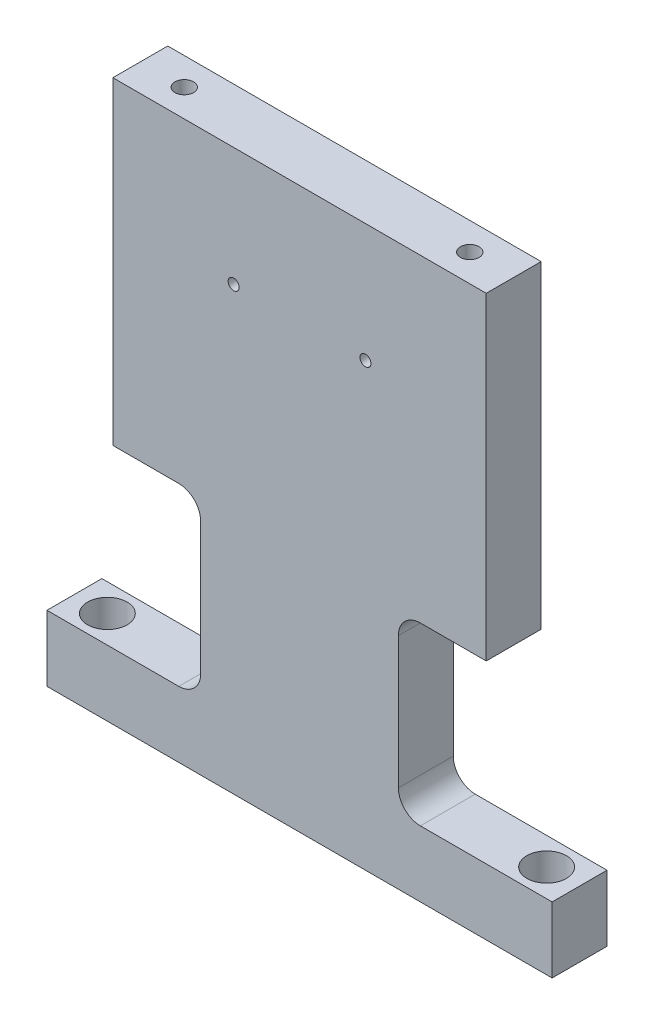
ISO-10303-21;
HEADER;
FILE_DESCRIPTION(('STEP AP214'),'2;1');
FILE_NAME('part.step','',(''),(''),'','','');
FILE_SCHEMA(('AUTOMOTIVE_DESIGN { 1 0 10303 214 1 1 1 1 }'));
ENDSEC;
DATA;
#1=APPLICATION_CONTEXT('core data for automotive mechanical design processes');
#2=APPLICATION_PROTOCOL_DEFINITION('international standard','automotive_design',2000,#1);
#3=PRODUCT_CONTEXT('',#1,'mechanical');
#4=PRODUCT('Part','Part','',(#3));
#5=PRODUCT_RELATED_PRODUCT_CATEGORY('part','',(#4));
#6=PRODUCT_DEFINITION_FORMATION('','',#4);
#7=PRODUCT_DEFINITION_CONTEXT('part definition',#1,'design');
#8=PRODUCT_DEFINITION('design','',#6,#7);
#9=PRODUCT_DEFINITION_SHAPE('','',#8);
#10=(LENGTH_UNIT() NAMED_UNIT(*) SI_UNIT(.MILLI.,.METRE.));
#11=(NAMED_UNIT(*) PLANE_ANGLE_UNIT() SI_UNIT($,.RADIAN.));
#12=(NAMED_UNIT(*) SI_UNIT($,.STERADIAN.) SOLID_ANGLE_UNIT());
#13=UNCERTAINTY_MEASURE_WITH_UNIT(LENGTH_MEASURE(1.E-05),#10,'distance_accuracy_value','');
#14=(GEOMETRIC_REPRESENTATION_CONTEXT(3) GLOBAL_UNCERTAINTY_ASSIGNED_CONTEXT((#13)) GLOBAL_UNIT_ASSIGNED_CONTEXT((#10,
#11,#12)) REPRESENTATION_CONTEXT('',''));
#15=CARTESIAN_POINT('',(0.,0.,0.));
#16=DIRECTION('',(0.,0.,1.));
#17=DIRECTION('',(1.,0.,0.));
#18=AXIS2_PLACEMENT_3D('',#15,#16,#17);
#19=CARTESIAN_POINT('',(0.,0.,25.));
#20=DIRECTION('',(0.,1.,0.));
#21=DIRECTION('',(0.,0.,1.));
#22=AXIS2_PLACEMENT_3D('',#19,#20,#21);
#23=PLANE('',#22);
#24=CARTESIAN_POINT('',(-15.,0.,12.5));
#25=DIRECTION('',(0.,1.,0.));
#26=DIRECTION('',(0.,0.,1.));
#27=AXIS2_PLACEMENT_3D('',#24,#25,#26);
#28=CIRCLE('',#27,5.24999999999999);
#29=CARTESIAN_POINT('',(-15.,0.,17.75));
#30=VERTEX_POINT('',#29);
#31=EDGE_CURVE('E228',#30,#30,#28,.T.);
#32=ORIENTED_EDGE('',*,*,#31,.T.);
#33=EDGE_LOOP('',(#32));
#34=FACE_BOUND('',#33,.T.);
#35=CARTESIAN_POINT('',(185.,0.,12.5));
#36=DIRECTION('',(0.,1.,0.));
#37=DIRECTION('',(0.,0.,1.));
#38=AXIS2_PLACEMENT_3D('',#35,#36,#37);
#39=CIRCLE('',#38,5.25);
#40=CARTESIAN_POINT('',(185.,0.,17.75));
#41=VERTEX_POINT('',#40);
#42=EDGE_CURVE('E240',#41,#41,#39,.T.);
#43=ORIENTED_EDGE('',*,*,#42,.T.);
#44=EDGE_LOOP('',(#43));
#45=FACE_BOUND('',#44,.T.);
#46=DIRECTION('',(1.,0.,0.));
#47=VECTOR('',#46,1.);
#48=CARTESIAN_POINT('',(0.,0.,0.));
#49=LINE('',#48,#47);
#50=CARTESIAN_POINT('',(-30.,0.,0.));
#51=VERTEX_POINT('',#50);
#52=CARTESIAN_POINT('',(200.,0.,0.));
#53=VERTEX_POINT('',#52);
#54=EDGE_CURVE('E96',#51,#53,#49,.T.);
#55=ORIENTED_EDGE('',*,*,#54,.T.);
#56=DIRECTION('',(0.,0.,1.));
#57=VECTOR('',#56,1.);
#58=CARTESIAN_POINT('',(200.,0.,0.));
#59=LINE('',#58,#57);
#60=CARTESIAN_POINT('',(200.,0.,25.));
#61=VERTEX_POINT('',#60);
#62=EDGE_CURVE('E256',#53,#61,#59,.T.);
#63=ORIENTED_EDGE('',*,*,#62,.T.);
#64=DIRECTION('',(1.,0.,0.));
#65=VECTOR('',#64,1.);
#66=CARTESIAN_POINT('',(0.,0.,25.));
#67=LINE('',#66,#65);
#68=CARTESIAN_POINT('',(-30.,0.,25.));
#69=VERTEX_POINT('',#68);
#70=EDGE_CURVE('E350',#69,#61,#67,.T.);
#71=ORIENTED_EDGE('',*,*,#70,.F.);
#72=DIRECTION('',(0.,0.,1.));
#73=VECTOR('',#72,1.);
#74=CARTESIAN_POINT('',(-30.,0.,0.));
#75=LINE('',#74,#73);
#76=EDGE_CURVE('E260',#51,#69,#75,.T.);
#77=ORIENTED_EDGE('',*,*,#76,.F.);
#78=EDGE_LOOP('',(#55,#63,#71,#77));
#79=FACE_BOUND('',#78,.T.);
#80=ADVANCED_FACE('F41',(#34,#45,#79),#23,.F.);
#81=CARTESIAN_POINT('',(170.,0.,25.));
#82=DIRECTION('',(-1.,0.,0.));
#83=DIRECTION('',(0.,0.,1.));
#84=AXIS2_PLACEMENT_3D('',#81,#82,#83);
#85=PLANE('',#84);
#86=DIRECTION('',(0.,1.,0.));
#87=VECTOR('',#86,1.);
#88=CARTESIAN_POINT('',(170.,0.,25.));
#89=LINE('',#88,#87);
#90=CARTESIAN_POINT('',(170.,110.,25.));
#91=VERTEX_POINT('',#90);
#92=CARTESIAN_POINT('',(170.,255.,25.));
#93=VERTEX_POINT('',#92);
#94=EDGE_CURVE('E351',#91,#93,#89,.T.);
#95=ORIENTED_EDGE('',*,*,#94,.F.);
#96=DIRECTION('',(0.,0.,-1.));
#97=VECTOR('',#96,1.);
#98=CARTESIAN_POINT('',(170.,110.,25.));
#99=LINE('',#98,#97);
#100=CARTESIAN_POINT('',(170.,110.,0.));
#101=VERTEX_POINT('',#100);
#102=EDGE_CURVE('E97',#91,#101,#99,.T.);
#103=ORIENTED_EDGE('',*,*,#102,.T.);
#104=DIRECTION('',(0.,1.,0.));
#105=VECTOR('',#104,1.);
#106=CARTESIAN_POINT('',(170.,0.,0.));
#107=LINE('',#106,#105);
#108=CARTESIAN_POINT('',(170.,255.,0.));
#109=VERTEX_POINT('',#108);
#110=EDGE_CURVE('E86',#101,#109,#107,.T.);
#111=ORIENTED_EDGE('',*,*,#110,.T.);
#112=DIRECTION('',(0.,0.,-1.));
#113=VECTOR('',#112,1.);
#114=CARTESIAN_POINT('',(170.,255.,25.));
#115=LINE('',#114,#113);
#116=EDGE_CURVE('E11',#93,#109,#115,.T.);
#117=ORIENTED_EDGE('',*,*,#116,.F.);
#118=EDGE_LOOP('',(#95,#103,#111,#117));
#119=FACE_BOUND('',#118,.T.);
#120=ADVANCED_FACE('F109',(#119),#85,.F.);
#121=CARTESIAN_POINT('',(0.,0.,25.));
#122=DIRECTION('',(1.,0.,0.));
#123=DIRECTION('',(0.,0.,-1.));
#124=AXIS2_PLACEMENT_3D('',#121,#122,#123);
#125=PLANE('',#124);
#126=DIRECTION('',(0.,-1.,0.));
#127=VECTOR('',#126,1.);
#128=CARTESIAN_POINT('',(0.,0.,0.));
#129=LINE('',#128,#127);
#130=CARTESIAN_POINT('',(0.,255.,0.));
#131=VERTEX_POINT('',#130);
#132=CARTESIAN_POINT('',(0.,110.,0.));
#133=VERTEX_POINT('',#132);
#134=EDGE_CURVE('E90',#131,#133,#129,.T.);
#135=ORIENTED_EDGE('',*,*,#134,.T.);
#136=DIRECTION('',(0.,0.,-1.));
#137=VECTOR('',#136,1.);
#138=CARTESIAN_POINT('',(0.,110.,25.));
#139=LINE('',#138,#137);
#140=CARTESIAN_POINT('',(0.,110.,25.));
#141=VERTEX_POINT('',#140);
#142=EDGE_CURVE('E56',#141,#133,#139,.T.);
#143=ORIENTED_EDGE('',*,*,#142,.F.);
#144=DIRECTION('',(0.,-1.,0.));
#145=VECTOR('',#144,1.);
#146=CARTESIAN_POINT('',(0.,0.,25.));
#147=LINE('',#146,#145);
#148=CARTESIAN_POINT('',(0.,255.,25.));
#149=VERTEX_POINT('',#148);
#150=EDGE_CURVE('E85',#149,#141,#147,.T.);
#151=ORIENTED_EDGE('',*,*,#150,.F.);
#152=DIRECTION('',(0.,0.,-1.));
#153=VECTOR('',#152,1.);
#154=CARTESIAN_POINT('',(0.,255.,25.));
#155=LINE('',#154,#153);
#156=EDGE_CURVE('E49',#149,#131,#155,.T.);
#157=ORIENTED_EDGE('',*,*,#156,.T.);
#158=EDGE_LOOP('',(#135,#143,#151,#157));
#159=FACE_BOUND('',#158,.T.);
#160=ADVANCED_FACE('F43',(#159),#125,.F.);
#161=CARTESIAN_POINT('',(0.,255.,25.));
#162=DIRECTION('',(0.,-1.,0.));
#163=DIRECTION('',(0.,0.,-1.));
#164=AXIS2_PLACEMENT_3D('',#161,#162,#163);
#165=PLANE('',#164);
#166=CARTESIAN_POINT('',(20.,255.,12.5));
#167=DIRECTION('',(0.,1.,0.));
#168=DIRECTION('',(0.,0.,1.));
#169=AXIS2_PLACEMENT_3D('',#166,#167,#168);
#170=CIRCLE('',#169,4.24999999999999);
#171=CARTESIAN_POINT('',(20.,255.,16.75));
#172=VERTEX_POINT('',#171);
#173=EDGE_CURVE('E209',#172,#172,#170,.T.);
#174=ORIENTED_EDGE('',*,*,#173,.F.);
#175=EDGE_LOOP('',(#174));
#176=FACE_BOUND('',#175,.T.);
#177=CARTESIAN_POINT('',(150.,255.,12.5));
#178=DIRECTION('',(0.,1.,0.));
#179=DIRECTION('',(0.,0.,1.));
#180=AXIS2_PLACEMENT_3D('',#177,#178,#179);
#181=CIRCLE('',#180,4.25);
#182=CARTESIAN_POINT('',(150.,255.,16.75));
#183=VERTEX_POINT('',#182);
#184=EDGE_CURVE('E208',#183,#183,#181,.T.);
#185=ORIENTED_EDGE('',*,*,#184,.F.);
#186=EDGE_LOOP('',(#185));
#187=FACE_BOUND('',#186,.T.);
#188=DIRECTION('',(-1.,0.,0.));
#189=VECTOR('',#188,1.);
#190=CARTESIAN_POINT('',(0.,255.,0.));
#191=LINE('',#190,#189);
#192=EDGE_CURVE('E77',#109,#131,#191,.T.);
#193=ORIENTED_EDGE('',*,*,#192,.T.);
#194=ORIENTED_EDGE('',*,*,#156,.F.);
#195=DIRECTION('',(-1.,0.,0.));
#196=VECTOR('',#195,1.);
#197=CARTESIAN_POINT('',(0.,255.,25.));
#198=LINE('',#197,#196);
#199=EDGE_CURVE('E65',#93,#149,#198,.T.);
#200=ORIENTED_EDGE('',*,*,#199,.F.);
#201=ORIENTED_EDGE('',*,*,#116,.T.);
#202=EDGE_LOOP('',(#193,#194,#200,#201));
#203=FACE_BOUND('',#202,.T.);
#204=ADVANCED_FACE('F79',(#176,#187,#203),#165,.F.);
#205=CARTESIAN_POINT('',(0.,255.,25.));
#206=DIRECTION('',(0.,0.,-1.));
#207=DIRECTION('',(-1.,0.,0.));
#208=AXIS2_PLACEMENT_3D('',#205,#206,#207);
#209=PLANE('',#208);
#210=CARTESIAN_POINT('',(55.,201.,25.));
#211=DIRECTION('',(0.,0.,-1.));
#212=DIRECTION('',(-1.,0.,0.));
#213=AXIS2_PLACEMENT_3D('',#210,#211,#212);
#214=CIRCLE('',#213,2.5);
#215=CARTESIAN_POINT('',(52.5,201.,25.));
#216=VERTEX_POINT('',#215);
#217=EDGE_CURVE('E259',#216,#216,#214,.T.);
#218=ORIENTED_EDGE('',*,*,#217,.T.);
#219=EDGE_LOOP('',(#218));
#220=FACE_BOUND('',#219,.T.);
#221=CARTESIAN_POINT('',(115.,201.,25.));
#222=DIRECTION('',(0.,0.,-1.));
#223=DIRECTION('',(-1.,0.,0.));
#224=AXIS2_PLACEMENT_3D('',#221,#222,#223);
#225=CIRCLE('',#224,2.5);
#226=CARTESIAN_POINT('',(112.5,201.,25.));
#227=VERTEX_POINT('',#226);
#228=EDGE_CURVE('E273',#227,#227,#225,.T.);
#229=ORIENTED_EDGE('',*,*,#228,.T.);
#230=EDGE_LOOP('',(#229));
#231=FACE_BOUND('',#230,.T.);
#232=CARTESIAN_POINT('',(30.,40.,25.));
#233=DIRECTION('',(0.,0.,-1.));
#234=DIRECTION('',(-1.,0.,0.));
#235=AXIS2_PLACEMENT_3D('',#232,#233,#234);
#236=CIRCLE('',#235,10.);
#237=CARTESIAN_POINT('',(40.,40.,25.));
#238=VERTEX_POINT('',#237);
#239=CARTESIAN_POINT('',(30.,30.,25.));
#240=VERTEX_POINT('',#239);
#241=EDGE_CURVE('E289',#238,#240,#236,.T.);
#242=ORIENTED_EDGE('',*,*,#241,.T.);
#243=DIRECTION('',(-1.,0.,0.));
#244=VECTOR('',#243,1.);
#245=CARTESIAN_POINT('',(30.,30.,25.));
#246=LINE('',#245,#244);
#247=CARTESIAN_POINT('',(-30.,30.,25.));
#248=VERTEX_POINT('',#247);
#249=EDGE_CURVE('E292',#240,#248,#246,.T.);
#250=ORIENTED_EDGE('',*,*,#249,.T.);
#251=DIRECTION('',(0.,-1.,0.));
#252=VECTOR('',#251,1.);
#253=CARTESIAN_POINT('',(-30.,30.,25.));
#254=LINE('',#253,#252);
#255=EDGE_CURVE('E248',#248,#69,#254,.T.);
#256=ORIENTED_EDGE('',*,*,#255,.T.);
#257=ORIENTED_EDGE('',*,*,#70,.T.);
#258=DIRECTION('',(0.,1.,0.));
#259=VECTOR('',#258,1.);
#260=CARTESIAN_POINT('',(200.,30.,25.));
#261=LINE('',#260,#259);
#262=CARTESIAN_POINT('',(200.,30.,25.));
#263=VERTEX_POINT('',#262);
#264=EDGE_CURVE('E243',#61,#263,#261,.T.);
#265=ORIENTED_EDGE('',*,*,#264,.T.);
#266=DIRECTION('',(-1.,0.,0.));
#267=VECTOR('',#266,1.);
#268=CARTESIAN_POINT('',(170.,30.,25.));
#269=LINE('',#268,#267);
#270=CARTESIAN_POINT('',(140.,30.,25.));
#271=VERTEX_POINT('',#270);
#272=EDGE_CURVE('E315',#263,#271,#269,.T.);
#273=ORIENTED_EDGE('',*,*,#272,.T.);
#274=CARTESIAN_POINT('',(140.,40.,25.));
#275=DIRECTION('',(0.,0.,-1.));
#276=DIRECTION('',(-1.,0.,0.));
#277=AXIS2_PLACEMENT_3D('',#274,#275,#276);
#278=CIRCLE('',#277,10.);
#279=CARTESIAN_POINT('',(130.,40.,25.));
#280=VERTEX_POINT('',#279);
#281=EDGE_CURVE('E318',#271,#280,#278,.T.);
#282=ORIENTED_EDGE('',*,*,#281,.T.);
#283=DIRECTION('',(0.,1.,0.));
#284=VECTOR('',#283,1.);
#285=CARTESIAN_POINT('',(130.,100.,25.));
#286=LINE('',#285,#284);
#287=CARTESIAN_POINT('',(130.,100.,25.));
#288=VERTEX_POINT('',#287);
#289=EDGE_CURVE('E321',#280,#288,#286,.T.);
#290=ORIENTED_EDGE('',*,*,#289,.T.);
#291=CARTESIAN_POINT('',(140.,100.,25.));
#292=DIRECTION('',(0.,0.,-1.));
#293=DIRECTION('',(1.,0.,0.));
#294=AXIS2_PLACEMENT_3D('',#291,#292,#293);
#295=CIRCLE('',#294,10.);
#296=CARTESIAN_POINT('',(140.,110.,25.));
#297=VERTEX_POINT('',#296);
#298=EDGE_CURVE('E324',#288,#297,#295,.T.);
#299=ORIENTED_EDGE('',*,*,#298,.T.);
#300=DIRECTION('',(1.,0.,0.));
#301=VECTOR('',#300,1.);
#302=CARTESIAN_POINT('',(170.,110.,25.));
#303=LINE('',#302,#301);
#304=EDGE_CURVE('E327',#297,#91,#303,.T.);
#305=ORIENTED_EDGE('',*,*,#304,.T.);
#306=ORIENTED_EDGE('',*,*,#94,.T.);
#307=ORIENTED_EDGE('',*,*,#199,.T.);
#308=ORIENTED_EDGE('',*,*,#150,.T.);
#309=DIRECTION('',(1.,0.,0.));
#310=VECTOR('',#309,1.);
#311=CARTESIAN_POINT('',(30.,110.,25.));
#312=LINE('',#311,#310);
#313=CARTESIAN_POINT('',(30.,110.,25.));
#314=VERTEX_POINT('',#313);
#315=EDGE_CURVE('E279',#141,#314,#312,.T.);
#316=ORIENTED_EDGE('',*,*,#315,.T.);
#317=CARTESIAN_POINT('',(30.,100.,25.));
#318=DIRECTION('',(0.,0.,-1.));
#319=DIRECTION('',(-1.,0.,0.));
#320=AXIS2_PLACEMENT_3D('',#317,#318,#319);
#321=CIRCLE('',#320,10.);
#322=CARTESIAN_POINT('',(40.,100.,25.));
#323=VERTEX_POINT('',#322);
#324=EDGE_CURVE('E282',#314,#323,#321,.T.);
#325=ORIENTED_EDGE('',*,*,#324,.T.);
#326=DIRECTION('',(0.,-1.,0.));
#327=VECTOR('',#326,1.);
#328=CARTESIAN_POINT('',(40.,100.,25.));
#329=LINE('',#328,#327);
#330=EDGE_CURVE('E286',#323,#238,#329,.T.);
#331=ORIENTED_EDGE('',*,*,#330,.T.);
#332=EDGE_LOOP('',(#242,#250,#256,#257,#265,#273,#282,#290,#299,#305,#306,#307,#308,#316,#325,#331));
#333=FACE_BOUND('',#332,.T.);
#334=ADVANCED_FACE('F352',(#220,#231,#333),#209,.F.);
#335=CARTESIAN_POINT('',(0.,255.,0.));
#336=DIRECTION('',(0.,0.,-1.));
#337=DIRECTION('',(-1.,0.,0.));
#338=AXIS2_PLACEMENT_3D('',#335,#336,#337);
#339=PLANE('',#338);
#340=CARTESIAN_POINT('',(140.,40.,0.));
#341=DIRECTION('',(0.,0.,-1.));
#342=DIRECTION('',(-1.,0.,0.));
#343=AXIS2_PLACEMENT_3D('',#340,#341,#342);
#344=CIRCLE('',#343,10.);
#345=CARTESIAN_POINT('',(140.,30.,0.));
#346=VERTEX_POINT('',#345);
#347=CARTESIAN_POINT('',(130.,40.,0.));
#348=VERTEX_POINT('',#347);
#349=EDGE_CURVE('E333',#346,#348,#344,.T.);
#350=ORIENTED_EDGE('',*,*,#349,.F.);
#351=DIRECTION('',(-1.,0.,0.));
#352=VECTOR('',#351,1.);
#353=CARTESIAN_POINT('',(170.,30.,0.));
#354=LINE('',#353,#352);
#355=CARTESIAN_POINT('',(200.,30.,0.));
#356=VERTEX_POINT('',#355);
#357=EDGE_CURVE('E307',#356,#346,#354,.T.);
#358=ORIENTED_EDGE('',*,*,#357,.F.);
#359=DIRECTION('',(0.,1.,0.));
#360=VECTOR('',#359,1.);
#361=CARTESIAN_POINT('',(200.,30.,0.));
#362=LINE('',#361,#360);
#363=EDGE_CURVE('E244',#53,#356,#362,.T.);
#364=ORIENTED_EDGE('',*,*,#363,.F.);
#365=ORIENTED_EDGE('',*,*,#54,.F.);
#366=DIRECTION('',(0.,-1.,0.));
#367=VECTOR('',#366,1.);
#368=CARTESIAN_POINT('',(-30.,30.,0.));
#369=LINE('',#368,#367);
#370=CARTESIAN_POINT('',(-30.,30.,0.));
#371=VERTEX_POINT('',#370);
#372=EDGE_CURVE('E247',#371,#51,#369,.T.);
#373=ORIENTED_EDGE('',*,*,#372,.F.);
#374=DIRECTION('',(-1.,0.,0.));
#375=VECTOR('',#374,1.);
#376=CARTESIAN_POINT('',(30.,30.,0.));
#377=LINE('',#376,#375);
#378=CARTESIAN_POINT('',(30.,30.,0.));
#379=VERTEX_POINT('',#378);
#380=EDGE_CURVE('E283',#379,#371,#377,.T.);
#381=ORIENTED_EDGE('',*,*,#380,.F.);
#382=CARTESIAN_POINT('',(30.,40.,0.));
#383=DIRECTION('',(0.,0.,-1.));
#384=DIRECTION('',(-1.,0.,0.));
#385=AXIS2_PLACEMENT_3D('',#382,#383,#384);
#386=CIRCLE('',#385,10.);
#387=CARTESIAN_POINT('',(40.,40.,0.));
#388=VERTEX_POINT('',#387);
#389=EDGE_CURVE('E301',#388,#379,#386,.T.);
#390=ORIENTED_EDGE('',*,*,#389,.F.);
#391=DIRECTION('',(0.,-1.,0.));
#392=VECTOR('',#391,1.);
#393=CARTESIAN_POINT('',(40.,100.,0.));
#394=LINE('',#393,#392);
#395=CARTESIAN_POINT('',(40.,100.,0.));
#396=VERTEX_POINT('',#395);
#397=EDGE_CURVE('E298',#396,#388,#394,.T.);
#398=ORIENTED_EDGE('',*,*,#397,.F.);
#399=CARTESIAN_POINT('',(30.,100.,0.));
#400=DIRECTION('',(0.,0.,-1.));
#401=DIRECTION('',(-1.,0.,0.));
#402=AXIS2_PLACEMENT_3D('',#399,#400,#401);
#403=CIRCLE('',#402,10.);
#404=CARTESIAN_POINT('',(30.,110.,0.));
#405=VERTEX_POINT('',#404);
#406=EDGE_CURVE('E295',#405,#396,#403,.T.);
#407=ORIENTED_EDGE('',*,*,#406,.F.);
#408=DIRECTION('',(1.,0.,0.));
#409=VECTOR('',#408,1.);
#410=CARTESIAN_POINT('',(30.,110.,0.));
#411=LINE('',#410,#409);
#412=EDGE_CURVE('E95',#133,#405,#411,.T.);
#413=ORIENTED_EDGE('',*,*,#412,.F.);
#414=ORIENTED_EDGE('',*,*,#134,.F.);
#415=ORIENTED_EDGE('',*,*,#192,.F.);
#416=ORIENTED_EDGE('',*,*,#110,.F.);
#417=DIRECTION('',(1.,0.,0.));
#418=VECTOR('',#417,1.);
#419=CARTESIAN_POINT('',(170.,110.,0.));
#420=LINE('',#419,#418);
#421=CARTESIAN_POINT('',(140.,110.,0.));
#422=VERTEX_POINT('',#421);
#423=EDGE_CURVE('E116',#422,#101,#420,.T.);
#424=ORIENTED_EDGE('',*,*,#423,.F.);
#425=CARTESIAN_POINT('',(140.,100.,0.));
#426=DIRECTION('',(0.,0.,-1.));
#427=DIRECTION('',(1.,0.,0.));
#428=AXIS2_PLACEMENT_3D('',#425,#426,#427);
#429=CIRCLE('',#428,10.);
#430=CARTESIAN_POINT('',(130.,100.,0.));
#431=VERTEX_POINT('',#430);
#432=EDGE_CURVE('E339',#431,#422,#429,.T.);
#433=ORIENTED_EDGE('',*,*,#432,.F.);
#434=DIRECTION('',(0.,1.,0.));
#435=VECTOR('',#434,1.);
#436=CARTESIAN_POINT('',(130.,100.,0.));
#437=LINE('',#436,#435);
#438=EDGE_CURVE('E336',#348,#431,#437,.T.);
#439=ORIENTED_EDGE('',*,*,#438,.F.);
#440=EDGE_LOOP('',(#350,#358,#364,#365,#373,#381,#390,#398,#407,#413,#414,#415,#416,#424,#433,#439));
#441=FACE_BOUND('',#440,.T.);
#442=CARTESIAN_POINT('',(55.,201.,0.));
#443=DIRECTION('',(0.,0.,-1.));
#444=DIRECTION('',(-1.,0.,0.));
#445=AXIS2_PLACEMENT_3D('',#442,#443,#444);
#446=CIRCLE('',#445,2.5);
#447=CARTESIAN_POINT('',(52.5,201.,0.));
#448=VERTEX_POINT('',#447);
#449=EDGE_CURVE('E270',#448,#448,#446,.T.);
#450=ORIENTED_EDGE('',*,*,#449,.F.);
#451=EDGE_LOOP('',(#450));
#452=FACE_BOUND('',#451,.T.);
#453=CARTESIAN_POINT('',(115.,201.,0.));
#454=DIRECTION('',(0.,0.,-1.));
#455=DIRECTION('',(-1.,0.,0.));
#456=AXIS2_PLACEMENT_3D('',#453,#454,#455);
#457=CIRCLE('',#456,2.5);
#458=CARTESIAN_POINT('',(112.5,201.,0.));
#459=VERTEX_POINT('',#458);
#460=EDGE_CURVE('E276',#459,#459,#457,.T.);
#461=ORIENTED_EDGE('',*,*,#460,.F.);
#462=EDGE_LOOP('',(#461));
#463=FACE_BOUND('',#462,.T.);
#464=ADVANCED_FACE('F92',(#441,#452,#463),#339,.T.);
#465=CARTESIAN_POINT('',(170.,110.,25.));
#466=DIRECTION('',(0.,1.,0.));
#467=DIRECTION('',(0.,0.,1.));
#468=AXIS2_PLACEMENT_3D('',#465,#466,#467);
#469=PLANE('',#468);
#470=ORIENTED_EDGE('',*,*,#423,.T.);
#471=ORIENTED_EDGE('',*,*,#102,.F.);
#472=ORIENTED_EDGE('',*,*,#304,.F.);
#473=DIRECTION('',(0.,0.,-1.));
#474=VECTOR('',#473,1.);
#475=CARTESIAN_POINT('',(140.,110.,25.));
#476=LINE('',#475,#474);
#477=EDGE_CURVE('E102',#297,#422,#476,.T.);
#478=ORIENTED_EDGE('',*,*,#477,.T.);
#479=EDGE_LOOP('',(#470,#471,#472,#478));
#480=FACE_BOUND('',#479,.T.);
#481=ADVANCED_FACE('F355',(#480),#469,.F.);
#482=CARTESIAN_POINT('',(140.,100.,25.));
#483=DIRECTION('',(0.,0.,-1.));
#484=DIRECTION('',(-1.,0.,0.));
#485=AXIS2_PLACEMENT_3D('',#482,#483,#484);
#486=CYLINDRICAL_SURFACE('',#485,10.);
#487=ORIENTED_EDGE('',*,*,#432,.T.);
#488=ORIENTED_EDGE('',*,*,#477,.F.);
#489=ORIENTED_EDGE('',*,*,#298,.F.);
#490=DIRECTION('',(0.,0.,-1.));
#491=VECTOR('',#490,1.);
#492=CARTESIAN_POINT('',(130.,100.,25.));
#493=LINE('',#492,#491);
#494=EDGE_CURVE('E344',#288,#431,#493,.T.);
#495=ORIENTED_EDGE('',*,*,#494,.T.);
#496=EDGE_LOOP('',(#487,#488,#489,#495));
#497=FACE_BOUND('',#496,.T.);
#498=ADVANCED_FACE('F357',(#497),#486,.F.);
#499=CARTESIAN_POINT('',(130.,100.,25.));
#500=DIRECTION('',(-1.,0.,0.));
#501=DIRECTION('',(0.,0.,1.));
#502=AXIS2_PLACEMENT_3D('',#499,#500,#501);
#503=PLANE('',#502);
#504=ORIENTED_EDGE('',*,*,#438,.T.);
#505=ORIENTED_EDGE('',*,*,#494,.F.);
#506=ORIENTED_EDGE('',*,*,#289,.F.);
#507=DIRECTION('',(0.,0.,-1.));
#508=VECTOR('',#507,1.);
#509=CARTESIAN_POINT('',(130.,40.,25.));
#510=LINE('',#509,#508);
#511=EDGE_CURVE('E346',#280,#348,#510,.T.);
#512=ORIENTED_EDGE('',*,*,#511,.T.);
#513=EDGE_LOOP('',(#504,#505,#506,#512));
#514=FACE_BOUND('',#513,.T.);
#515=ADVANCED_FACE('F360',(#514),#503,.F.);
#516=CARTESIAN_POINT('',(140.,40.,25.));
#517=DIRECTION('',(0.,0.,-1.));
#518=DIRECTION('',(-1.,0.,0.));
#519=AXIS2_PLACEMENT_3D('',#516,#517,#518);
#520=CYLINDRICAL_SURFACE('',#519,10.);
#521=ORIENTED_EDGE('',*,*,#349,.T.);
#522=ORIENTED_EDGE('',*,*,#511,.F.);
#523=ORIENTED_EDGE('',*,*,#281,.F.);
#524=DIRECTION('',(0.,0.,-1.));
#525=VECTOR('',#524,1.);
#526=CARTESIAN_POINT('',(140.,30.,25.));
#527=LINE('',#526,#525);
#528=EDGE_CURVE('E330',#271,#346,#527,.T.);
#529=ORIENTED_EDGE('',*,*,#528,.T.);
#530=EDGE_LOOP('',(#521,#522,#523,#529));
#531=FACE_BOUND('',#530,.T.);
#532=ADVANCED_FACE('F364',(#531),#520,.F.);
#533=CARTESIAN_POINT('',(170.,30.,25.));
#534=DIRECTION('',(0.,-1.,0.));
#535=DIRECTION('',(0.,0.,-1.));
#536=AXIS2_PLACEMENT_3D('',#533,#534,#535);
#537=PLANE('',#536);
#538=CARTESIAN_POINT('',(185.,30.,12.5));
#539=DIRECTION('',(0.,1.,0.));
#540=DIRECTION('',(0.,0.,1.));
#541=AXIS2_PLACEMENT_3D('',#538,#539,#540);
#542=CIRCLE('',#541,9.00000000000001);
#543=CARTESIAN_POINT('',(185.,30.,21.5));
#544=VERTEX_POINT('',#543);
#545=EDGE_CURVE('E231',#544,#544,#542,.T.);
#546=ORIENTED_EDGE('',*,*,#545,.F.);
#547=EDGE_LOOP('',(#546));
#548=FACE_BOUND('',#547,.T.);
#549=ORIENTED_EDGE('',*,*,#357,.T.);
#550=ORIENTED_EDGE('',*,*,#528,.F.);
#551=ORIENTED_EDGE('',*,*,#272,.F.);
#552=DIRECTION('',(0.,0.,1.));
#553=VECTOR('',#552,1.);
#554=CARTESIAN_POINT('',(200.,30.,0.));
#555=LINE('',#554,#553);
#556=EDGE_CURVE('E251',#356,#263,#555,.T.);
#557=ORIENTED_EDGE('',*,*,#556,.F.);
#558=EDGE_LOOP('',(#549,#550,#551,#557));
#559=FACE_BOUND('',#558,.T.);
#560=ADVANCED_FACE('F367',(#548,#559),#537,.F.);
#561=CARTESIAN_POINT('',(30.,30.,25.));
#562=DIRECTION('',(0.,-1.,0.));
#563=DIRECTION('',(1.,0.,0.));
#564=AXIS2_PLACEMENT_3D('',#561,#562,#563);
#565=PLANE('',#564);
#566=CARTESIAN_POINT('',(-15.,30.,12.5));
#567=DIRECTION('',(0.,1.,0.));
#568=DIRECTION('',(0.,0.,1.));
#569=AXIS2_PLACEMENT_3D('',#566,#567,#568);
#570=CIRCLE('',#569,9.);
#571=CARTESIAN_POINT('',(-15.,30.,21.5));
#572=VERTEX_POINT('',#571);
#573=EDGE_CURVE('E219',#572,#572,#570,.T.);
#574=ORIENTED_EDGE('',*,*,#573,.F.);
#575=EDGE_LOOP('',(#574));
#576=FACE_BOUND('',#575,.T.);
#577=ORIENTED_EDGE('',*,*,#380,.T.);
#578=DIRECTION('',(0.,0.,1.));
#579=VECTOR('',#578,1.);
#580=CARTESIAN_POINT('',(-30.,30.,0.));
#581=LINE('',#580,#579);
#582=EDGE_CURVE('E263',#371,#248,#581,.T.);
#583=ORIENTED_EDGE('',*,*,#582,.T.);
#584=ORIENTED_EDGE('',*,*,#249,.F.);
#585=DIRECTION('',(0.,0.,-1.));
#586=VECTOR('',#585,1.);
#587=CARTESIAN_POINT('',(30.,30.,25.));
#588=LINE('',#587,#586);
#589=EDGE_CURVE('E305',#240,#379,#588,.T.);
#590=ORIENTED_EDGE('',*,*,#589,.T.);
#591=EDGE_LOOP('',(#577,#583,#584,#590));
#592=FACE_BOUND('',#591,.T.);
#593=ADVANCED_FACE('F384',(#576,#592),#565,.F.);
#594=CARTESIAN_POINT('',(30.,40.,25.));
#595=DIRECTION('',(0.,0.,-1.));
#596=DIRECTION('',(-1.,0.,0.));
#597=AXIS2_PLACEMENT_3D('',#594,#595,#596);
#598=CYLINDRICAL_SURFACE('',#597,10.);
#599=ORIENTED_EDGE('',*,*,#389,.T.);
#600=ORIENTED_EDGE('',*,*,#589,.F.);
#601=ORIENTED_EDGE('',*,*,#241,.F.);
#602=DIRECTION('',(0.,0.,-1.));
#603=VECTOR('',#602,1.);
#604=CARTESIAN_POINT('',(40.,40.,25.));
#605=LINE('',#604,#603);
#606=EDGE_CURVE('E308',#238,#388,#605,.T.);
#607=ORIENTED_EDGE('',*,*,#606,.T.);
#608=EDGE_LOOP('',(#599,#600,#601,#607));
#609=FACE_BOUND('',#608,.T.);
#610=ADVANCED_FACE('F388',(#609),#598,.F.);
#611=CARTESIAN_POINT('',(40.,100.,25.));
#612=DIRECTION('',(1.,0.,0.));
#613=DIRECTION('',(0.,1.,0.));
#614=AXIS2_PLACEMENT_3D('',#611,#612,#613);
#615=PLANE('',#614);
#616=ORIENTED_EDGE('',*,*,#397,.T.);
#617=ORIENTED_EDGE('',*,*,#606,.F.);
#618=ORIENTED_EDGE('',*,*,#330,.F.);
#619=DIRECTION('',(0.,0.,-1.));
#620=VECTOR('',#619,1.);
#621=CARTESIAN_POINT('',(40.,100.,25.));
#622=LINE('',#621,#620);
#623=EDGE_CURVE('E310',#323,#396,#622,.T.);
#624=ORIENTED_EDGE('',*,*,#623,.T.);
#625=EDGE_LOOP('',(#616,#617,#618,#624));
#626=FACE_BOUND('',#625,.T.);
#627=ADVANCED_FACE('F391',(#626),#615,.F.);
#628=CARTESIAN_POINT('',(30.,100.,25.));
#629=DIRECTION('',(0.,0.,-1.));
#630=DIRECTION('',(-1.,0.,0.));
#631=AXIS2_PLACEMENT_3D('',#628,#629,#630);
#632=CYLINDRICAL_SURFACE('',#631,10.);
#633=ORIENTED_EDGE('',*,*,#406,.T.);
#634=ORIENTED_EDGE('',*,*,#623,.F.);
#635=ORIENTED_EDGE('',*,*,#324,.F.);
#636=DIRECTION('',(0.,0.,-1.));
#637=VECTOR('',#636,1.);
#638=CARTESIAN_POINT('',(30.,110.,25.));
#639=LINE('',#638,#637);
#640=EDGE_CURVE('E312',#314,#405,#639,.T.);
#641=ORIENTED_EDGE('',*,*,#640,.T.);
#642=EDGE_LOOP('',(#633,#634,#635,#641));
#643=FACE_BOUND('',#642,.T.);
#644=ADVANCED_FACE('F393',(#643),#632,.F.);
#645=CARTESIAN_POINT('',(30.,110.,25.));
#646=DIRECTION('',(0.,1.,0.));
#647=DIRECTION('',(0.,0.,1.));
#648=AXIS2_PLACEMENT_3D('',#645,#646,#647);
#649=PLANE('',#648);
#650=ORIENTED_EDGE('',*,*,#412,.T.);
#651=ORIENTED_EDGE('',*,*,#640,.F.);
#652=ORIENTED_EDGE('',*,*,#315,.F.);
#653=ORIENTED_EDGE('',*,*,#142,.T.);
#654=EDGE_LOOP('',(#650,#651,#652,#653));
#655=FACE_BOUND('',#654,.T.);
#656=ADVANCED_FACE('F395',(#655),#649,.F.);
#657=CARTESIAN_POINT('',(115.,201.,0.));
#658=DIRECTION('',(0.,0.,-1.));
#659=DIRECTION('',(-1.,0.,0.));
#660=AXIS2_PLACEMENT_3D('',#657,#658,#659);
#661=CYLINDRICAL_SURFACE('',#660,2.5);
#662=ORIENTED_EDGE('',*,*,#228,.F.);
#663=EDGE_LOOP('',(#662));
#664=FACE_BOUND('',#663,.T.);
#665=ORIENTED_EDGE('',*,*,#460,.T.);
#666=EDGE_LOOP('',(#665));
#667=FACE_BOUND('',#666,.T.);
#668=ADVANCED_FACE('F397',(#664,#667),#661,.F.);
#669=CARTESIAN_POINT('',(55.,201.,0.));
#670=DIRECTION('',(0.,0.,-1.));
#671=DIRECTION('',(-1.,0.,0.));
#672=AXIS2_PLACEMENT_3D('',#669,#670,#671);
#673=CYLINDRICAL_SURFACE('',#672,2.5);
#674=ORIENTED_EDGE('',*,*,#217,.F.);
#675=EDGE_LOOP('',(#674));
#676=FACE_BOUND('',#675,.T.);
#677=ORIENTED_EDGE('',*,*,#449,.T.);
#678=EDGE_LOOP('',(#677));
#679=FACE_BOUND('',#678,.T.);
#680=ADVANCED_FACE('F403',(#676,#679),#673,.F.);
#681=CARTESIAN_POINT('',(200.,30.,0.));
#682=DIRECTION('',(1.,0.,0.));
#683=DIRECTION('',(0.,0.,-1.));
#684=AXIS2_PLACEMENT_3D('',#681,#682,#683);
#685=PLANE('',#684);
#686=ORIENTED_EDGE('',*,*,#264,.F.);
#687=ORIENTED_EDGE('',*,*,#62,.F.);
#688=ORIENTED_EDGE('',*,*,#363,.T.);
#689=ORIENTED_EDGE('',*,*,#556,.T.);
#690=EDGE_LOOP('',(#686,#687,#688,#689));
#691=FACE_BOUND('',#690,.T.);
#692=ADVANCED_FACE('F374',(#691),#685,.T.);
#693=CARTESIAN_POINT('',(-30.,30.,0.));
#694=DIRECTION('',(-1.,0.,0.));
#695=DIRECTION('',(0.,-1.,0.));
#696=AXIS2_PLACEMENT_3D('',#693,#694,#695);
#697=PLANE('',#696);
#698=ORIENTED_EDGE('',*,*,#255,.F.);
#699=ORIENTED_EDGE('',*,*,#582,.F.);
#700=ORIENTED_EDGE('',*,*,#372,.T.);
#701=ORIENTED_EDGE('',*,*,#76,.T.);
#702=EDGE_LOOP('',(#698,#699,#700,#701));
#703=FACE_BOUND('',#702,.T.);
#704=ADVANCED_FACE('F379',(#703),#697,.T.);
#705=CARTESIAN_POINT('',(185.,30.,12.5));
#706=DIRECTION('',(0.,1.,0.));
#707=DIRECTION('',(0.,0.,1.));
#708=AXIS2_PLACEMENT_3D('',#705,#706,#707);
#709=CYLINDRICAL_SURFACE('',#708,5.25);
#710=ORIENTED_EDGE('',*,*,#42,.F.);
#711=EDGE_LOOP('',(#710));
#712=FACE_BOUND('',#711,.T.);
#713=CARTESIAN_POINT('',(185.,17.,12.5));
#714=DIRECTION('',(0.,1.,0.));
#715=DIRECTION('',(0.,0.,1.));
#716=AXIS2_PLACEMENT_3D('',#713,#714,#715);
#717=CIRCLE('',#716,5.25);
#718=CARTESIAN_POINT('',(185.,17.,17.75));
#719=VERTEX_POINT('',#718);
#720=EDGE_CURVE('E237',#719,#719,#717,.T.);
#721=ORIENTED_EDGE('',*,*,#720,.T.);
#722=EDGE_LOOP('',(#721));
#723=FACE_BOUND('',#722,.T.);
#724=ADVANCED_FACE('F573',(#712,#723),#709,.F.);
#725=CARTESIAN_POINT('',(190.25,17.,12.5));
#726=DIRECTION('',(0.,-1.,0.));
#727=DIRECTION('',(0.,0.,-1.));
#728=AXIS2_PLACEMENT_3D('',#725,#726,#727);
#729=PLANE('',#728);
#730=ORIENTED_EDGE('',*,*,#720,.F.);
#731=EDGE_LOOP('',(#730));
#732=FACE_BOUND('',#731,.T.);
#733=CARTESIAN_POINT('',(185.,17.,12.5));
#734=DIRECTION('',(0.,1.,0.));
#735=DIRECTION('',(0.,0.,1.));
#736=AXIS2_PLACEMENT_3D('',#733,#734,#735);
#737=CIRCLE('',#736,9.00000000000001);
#738=CARTESIAN_POINT('',(185.,17.,21.5));
#739=VERTEX_POINT('',#738);
#740=EDGE_CURVE('E234',#739,#739,#737,.T.);
#741=ORIENTED_EDGE('',*,*,#740,.T.);
#742=EDGE_LOOP('',(#741));
#743=FACE_BOUND('',#742,.T.);
#744=ADVANCED_FACE('F583',(#732,#743),#729,.F.);
#745=CARTESIAN_POINT('',(185.,30.,12.5));
#746=DIRECTION('',(0.,1.,0.));
#747=DIRECTION('',(0.,0.,1.));
#748=AXIS2_PLACEMENT_3D('',#745,#746,#747);
#749=CYLINDRICAL_SURFACE('',#748,9.00000000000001);
#750=ORIENTED_EDGE('',*,*,#740,.F.);
#751=EDGE_LOOP('',(#750));
#752=FACE_BOUND('',#751,.T.);
#753=ORIENTED_EDGE('',*,*,#545,.T.);
#754=EDGE_LOOP('',(#753));
#755=FACE_BOUND('',#754,.T.);
#756=ADVANCED_FACE('F590',(#752,#755),#749,.F.);
#757=CARTESIAN_POINT('',(-15.,30.,12.5));
#758=DIRECTION('',(0.,1.,0.));
#759=DIRECTION('',(0.,0.,1.));
#760=AXIS2_PLACEMENT_3D('',#757,#758,#759);
#761=CYLINDRICAL_SURFACE('',#760,5.25);
#762=ORIENTED_EDGE('',*,*,#31,.F.);
#763=EDGE_LOOP('',(#762));
#764=FACE_BOUND('',#763,.T.);
#765=CARTESIAN_POINT('',(-15.,17.,12.5));
#766=DIRECTION('',(0.,1.,0.));
#767=DIRECTION('',(0.,0.,1.));
#768=AXIS2_PLACEMENT_3D('',#765,#766,#767);
#769=CIRCLE('',#768,5.25);
#770=CARTESIAN_POINT('',(-15.,17.,17.75));
#771=VERTEX_POINT('',#770);
#772=EDGE_CURVE('E225',#771,#771,#769,.T.);
#773=ORIENTED_EDGE('',*,*,#772,.T.);
#774=EDGE_LOOP('',(#773));
#775=FACE_BOUND('',#774,.T.);
#776=ADVANCED_FACE('F598',(#764,#775),#761,.F.);
#777=CARTESIAN_POINT('',(-9.75000000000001,17.,12.5));
#778=DIRECTION('',(0.,-1.,0.));
#779=DIRECTION('',(0.,0.,-1.));
#780=AXIS2_PLACEMENT_3D('',#777,#778,#779);
#781=PLANE('',#780);
#782=ORIENTED_EDGE('',*,*,#772,.F.);
#783=EDGE_LOOP('',(#782));
#784=FACE_BOUND('',#783,.T.);
#785=CARTESIAN_POINT('',(-15.,17.,12.5));
#786=DIRECTION('',(0.,1.,0.));
#787=DIRECTION('',(0.,0.,1.));
#788=AXIS2_PLACEMENT_3D('',#785,#786,#787);
#789=CIRCLE('',#788,9.);
#790=CARTESIAN_POINT('',(-15.,17.,21.5));
#791=VERTEX_POINT('',#790);
#792=EDGE_CURVE('E222',#791,#791,#789,.T.);
#793=ORIENTED_EDGE('',*,*,#792,.T.);
#794=EDGE_LOOP('',(#793));
#795=FACE_BOUND('',#794,.T.);
#796=ADVANCED_FACE('F606',(#784,#795),#781,.F.);
#797=CARTESIAN_POINT('',(-15.,30.,12.5));
#798=DIRECTION('',(0.,1.,0.));
#799=DIRECTION('',(0.,0.,1.));
#800=AXIS2_PLACEMENT_3D('',#797,#798,#799);
#801=CYLINDRICAL_SURFACE('',#800,9.);
#802=ORIENTED_EDGE('',*,*,#792,.F.);
#803=EDGE_LOOP('',(#802));
#804=FACE_BOUND('',#803,.T.);
#805=ORIENTED_EDGE('',*,*,#573,.T.);
#806=EDGE_LOOP('',(#805));
#807=FACE_BOUND('',#806,.T.);
#808=ADVANCED_FACE('F614',(#804,#807),#801,.F.);
#809=CARTESIAN_POINT('',(150.,225.,12.5));
#810=DIRECTION('',(0.,1.,0.));
#811=DIRECTION('',(0.,0.,1.));
#812=AXIS2_PLACEMENT_3D('',#809,#810,#811);
#813=CONICAL_SURFACE('',#812,4.25,1.02974425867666);
#814=CARTESIAN_POINT('',(150.,222.446342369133,12.5));
#815=VERTEX_POINT('',#814);
#816=VERTEX_LOOP('',#815);
#817=FACE_BOUND('',#816,.T.);
#818=CARTESIAN_POINT('',(150.,225.,12.5));
#819=DIRECTION('',(0.,1.,0.));
#820=DIRECTION('',(0.,0.,1.));
#821=AXIS2_PLACEMENT_3D('',#818,#819,#820);
#822=CIRCLE('',#821,4.25);
#823=CARTESIAN_POINT('',(150.,225.,16.75));
#824=VERTEX_POINT('',#823);
#825=EDGE_CURVE('E212',#824,#824,#822,.T.);
#826=ORIENTED_EDGE('',*,*,#825,.T.);
#827=EDGE_LOOP('',(#826));
#828=FACE_BOUND('',#827,.T.);
#829=ADVANCED_FACE('F621',(#817,#828),#813,.F.);
#830=CARTESIAN_POINT('',(150.,255.,12.5));
#831=DIRECTION('',(0.,1.,0.));
#832=DIRECTION('',(0.,0.,1.));
#833=AXIS2_PLACEMENT_3D('',#830,#831,#832);
#834=CYLINDRICAL_SURFACE('',#833,4.25);
#835=ORIENTED_EDGE('',*,*,#825,.F.);
#836=EDGE_LOOP('',(#835));
#837=FACE_BOUND('',#836,.T.);
#838=ORIENTED_EDGE('',*,*,#184,.T.);
#839=EDGE_LOOP('',(#838));
#840=FACE_BOUND('',#839,.T.);
#841=ADVANCED_FACE('F202',(#837,#840),#834,.F.);
#842=CARTESIAN_POINT('',(20.,225.,12.5));
#843=DIRECTION('',(0.,1.,0.));
#844=DIRECTION('',(0.,0.,1.));
#845=AXIS2_PLACEMENT_3D('',#842,#843,#844);
#846=CONICAL_SURFACE('',#845,4.24999999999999,1.02974425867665);
#847=CARTESIAN_POINT('',(20.,222.446342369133,12.5));
#848=VERTEX_POINT('',#847);
#849=VERTEX_LOOP('',#848);
#850=FACE_BOUND('',#849,.T.);
#851=CARTESIAN_POINT('',(20.,225.,12.5));
#852=DIRECTION('',(0.,1.,0.));
#853=DIRECTION('',(0.,0.,1.));
#854=AXIS2_PLACEMENT_3D('',#851,#852,#853);
#855=CIRCLE('',#854,4.24999999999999);
#856=CARTESIAN_POINT('',(20.,225.,16.75));
#857=VERTEX_POINT('',#856);
#858=EDGE_CURVE('E206',#857,#857,#855,.T.);
#859=ORIENTED_EDGE('',*,*,#858,.T.);
#860=EDGE_LOOP('',(#859));
#861=FACE_BOUND('',#860,.T.);
#862=ADVANCED_FACE('F198',(#850,#861),#846,.F.);
#863=CARTESIAN_POINT('',(20.,255.,12.5));
#864=DIRECTION('',(0.,1.,0.));
#865=DIRECTION('',(0.,0.,1.));
#866=AXIS2_PLACEMENT_3D('',#863,#864,#865);
#867=CYLINDRICAL_SURFACE('',#866,4.24999999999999);
#868=ORIENTED_EDGE('',*,*,#858,.F.);
#869=EDGE_LOOP('',(#868));
#870=FACE_BOUND('',#869,.T.);
#871=ORIENTED_EDGE('',*,*,#173,.T.);
#872=EDGE_LOOP('',(#871));
#873=FACE_BOUND('',#872,.T.);
#874=ADVANCED_FACE('F201',(#870,#873),#867,.F.);
#875=CLOSED_SHELL('',(#80,#120,#160,#204,#334,#464,#481,#498,#515,#532,#560,#593,#610,#627,#644,
#656,#668,#680,#692,#704,#724,#744,#756,#776,#796,#808,#829,#841,#862,#874));
#876=MANIFOLD_SOLID_BREP('B2',#875);
#877=ADVANCED_BREP_SHAPE_REPRESENTATION('',(#18,#876),#14);
#878=SHAPE_DEFINITION_REPRESENTATION(#9,#877);
ENDSEC;
END-ISO-10303-21;
